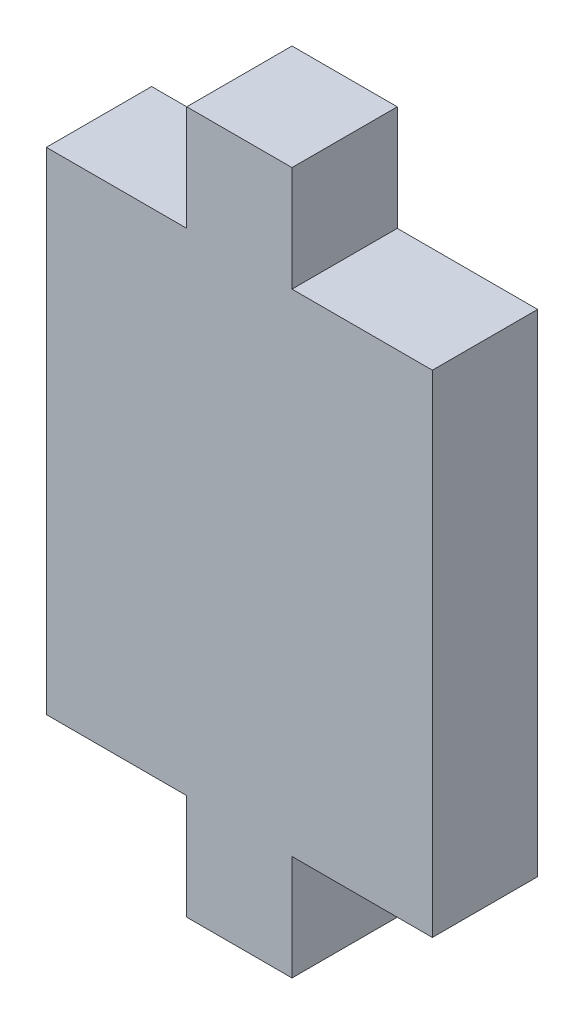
ISO-10303-21;
HEADER;
FILE_DESCRIPTION(('STEP AP214'),'2;1');
FILE_NAME('part.step','',(''),(''),'','','');
FILE_SCHEMA(('AUTOMOTIVE_DESIGN { 1 0 10303 214 1 1 1 1 }'));
ENDSEC;
DATA;
#1=APPLICATION_CONTEXT('core data for automotive mechanical design processes');
#2=APPLICATION_PROTOCOL_DEFINITION('international standard','automotive_design',2000,#1);
#3=PRODUCT_CONTEXT('',#1,'mechanical');
#4=PRODUCT('Part','Part','',(#3));
#5=PRODUCT_RELATED_PRODUCT_CATEGORY('part','',(#4));
#6=PRODUCT_DEFINITION_FORMATION('','',#4);
#7=PRODUCT_DEFINITION_CONTEXT('part definition',#1,'design');
#8=PRODUCT_DEFINITION('design','',#6,#7);
#9=PRODUCT_DEFINITION_SHAPE('','',#8);
#10=(LENGTH_UNIT() NAMED_UNIT(*) SI_UNIT(.MILLI.,.METRE.));
#11=(NAMED_UNIT(*) PLANE_ANGLE_UNIT() SI_UNIT($,.RADIAN.));
#12=(NAMED_UNIT(*) SI_UNIT($,.STERADIAN.) SOLID_ANGLE_UNIT());
#13=UNCERTAINTY_MEASURE_WITH_UNIT(LENGTH_MEASURE(1.E-05),#10,'distance_accuracy_value','');
#14=(GEOMETRIC_REPRESENTATION_CONTEXT(3) GLOBAL_UNCERTAINTY_ASSIGNED_CONTEXT((#13)) GLOBAL_UNIT_ASSIGNED_CONTEXT((#10,
#11,#12)) REPRESENTATION_CONTEXT('',''));
#15=CARTESIAN_POINT('',(0.,0.,0.));
#16=DIRECTION('',(0.,0.,1.));
#17=DIRECTION('',(1.,0.,0.));
#18=AXIS2_PLACEMENT_3D('',#15,#16,#17);
#19=CARTESIAN_POINT('',(34.925,-19.05,19.05));
#20=DIRECTION('',(0.,1.,0.));
#21=DIRECTION('',(0.,0.,1.));
#22=AXIS2_PLACEMENT_3D('',#19,#20,#21);
#23=PLANE('',#22);
#24=DIRECTION('',(1.,0.,0.));
#25=VECTOR('',#24,1.);
#26=CARTESIAN_POINT('',(34.925,-19.05,0.));
#27=LINE('',#26,#25);
#28=CARTESIAN_POINT('',(25.4,-19.05,0.));
#29=VERTEX_POINT('',#28);
#30=CARTESIAN_POINT('',(44.45,-19.05,0.));
#31=VERTEX_POINT('',#30);
#32=EDGE_CURVE('E159',#29,#31,#27,.T.);
#33=ORIENTED_EDGE('',*,*,#32,.T.);
#34=DIRECTION('',(0.,0.,-1.));
#35=VECTOR('',#34,1.);
#36=CARTESIAN_POINT('',(44.45,-19.05,19.05));
#37=LINE('',#36,#35);
#38=CARTESIAN_POINT('',(44.45,-19.05,19.05));
#39=VERTEX_POINT('',#38);
#40=EDGE_CURVE('E11',#39,#31,#37,.T.);
#41=ORIENTED_EDGE('',*,*,#40,.F.);
#42=DIRECTION('',(1.,0.,0.));
#43=VECTOR('',#42,1.);
#44=CARTESIAN_POINT('',(34.925,-19.05,19.05));
#45=LINE('',#44,#43);
#46=CARTESIAN_POINT('',(25.4,-19.05,19.05));
#47=VERTEX_POINT('',#46);
#48=EDGE_CURVE('E102',#47,#39,#45,.T.);
#49=ORIENTED_EDGE('',*,*,#48,.F.);
#50=DIRECTION('',(0.,0.,-1.));
#51=VECTOR('',#50,1.);
#52=CARTESIAN_POINT('',(25.4,-19.05,19.05));
#53=LINE('',#52,#51);
#54=EDGE_CURVE('E158',#47,#29,#53,.T.);
#55=ORIENTED_EDGE('',*,*,#54,.T.);
#56=EDGE_LOOP('',(#33,#41,#49,#55));
#57=FACE_BOUND('',#56,.T.);
#58=ADVANCED_FACE('F35',(#57),#23,.F.);
#59=CARTESIAN_POINT('',(44.45,-68.4294079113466,19.05));
#60=DIRECTION('',(1.,0.,0.));
#61=DIRECTION('',(0.,0.,-1.));
#62=AXIS2_PLACEMENT_3D('',#59,#60,#61);
#63=PLANE('',#62);
#64=DIRECTION('',(0.,-1.,0.));
#65=VECTOR('',#64,1.);
#66=CARTESIAN_POINT('',(44.45,-68.4294079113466,0.));
#67=LINE('',#66,#65);
#68=CARTESIAN_POINT('',(44.45,0.,0.));
#69=VERTEX_POINT('',#68);
#70=EDGE_CURVE('E162',#69,#31,#67,.T.);
#71=ORIENTED_EDGE('',*,*,#70,.F.);
#72=DIRECTION('',(0.,0.,-1.));
#73=VECTOR('',#72,1.);
#74=CARTESIAN_POINT('',(44.45,0.,19.05));
#75=LINE('',#74,#73);
#76=CARTESIAN_POINT('',(44.45,0.,19.05));
#77=VERTEX_POINT('',#76);
#78=EDGE_CURVE('E43',#77,#69,#75,.T.);
#79=ORIENTED_EDGE('',*,*,#78,.F.);
#80=DIRECTION('',(0.,-1.,0.));
#81=VECTOR('',#80,1.);
#82=CARTESIAN_POINT('',(44.45,-68.4294079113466,19.05));
#83=LINE('',#82,#81);
#84=EDGE_CURVE('E213',#77,#39,#83,.T.);
#85=ORIENTED_EDGE('',*,*,#84,.T.);
#86=ORIENTED_EDGE('',*,*,#40,.T.);
#87=EDGE_LOOP('',(#71,#79,#85,#86));
#88=FACE_BOUND('',#87,.T.);
#89=ADVANCED_FACE('F212',(#88),#63,.T.);
#90=CARTESIAN_POINT('',(34.925,0.,19.05));
#91=DIRECTION('',(0.,1.,0.));
#92=DIRECTION('',(0.,0.,1.));
#93=AXIS2_PLACEMENT_3D('',#90,#91,#92);
#94=PLANE('',#93);
#95=DIRECTION('',(1.,0.,0.));
#96=VECTOR('',#95,1.);
#97=CARTESIAN_POINT('',(34.925,0.,0.));
#98=LINE('',#97,#96);
#99=CARTESIAN_POINT('',(69.85,0.,0.));
#100=VERTEX_POINT('',#99);
#101=EDGE_CURVE('E165',#69,#100,#98,.T.);
#102=ORIENTED_EDGE('',*,*,#101,.T.);
#103=DIRECTION('',(0.,0.,-1.));
#104=VECTOR('',#103,1.);
#105=CARTESIAN_POINT('',(69.85,0.,19.05));
#106=LINE('',#105,#104);
#107=CARTESIAN_POINT('',(69.85,0.,19.05));
#108=VERTEX_POINT('',#107);
#109=EDGE_CURVE('E198',#108,#100,#106,.T.);
#110=ORIENTED_EDGE('',*,*,#109,.F.);
#111=DIRECTION('',(1.,0.,0.));
#112=VECTOR('',#111,1.);
#113=CARTESIAN_POINT('',(34.925,0.,19.05));
#114=LINE('',#113,#112);
#115=EDGE_CURVE('E144',#77,#108,#114,.T.);
#116=ORIENTED_EDGE('',*,*,#115,.F.);
#117=ORIENTED_EDGE('',*,*,#78,.T.);
#118=EDGE_LOOP('',(#102,#110,#116,#117));
#119=FACE_BOUND('',#118,.T.);
#120=ADVANCED_FACE('F203',(#119),#94,.F.);
#121=CARTESIAN_POINT('',(69.85,-68.4294079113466,19.05));
#122=DIRECTION('',(-1.,0.,0.));
#123=DIRECTION('',(0.,0.,1.));
#124=AXIS2_PLACEMENT_3D('',#121,#122,#123);
#125=PLANE('',#124);
#126=DIRECTION('',(0.,1.,0.));
#127=VECTOR('',#126,1.);
#128=CARTESIAN_POINT('',(69.85,-68.4294079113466,0.));
#129=LINE('',#128,#127);
#130=CARTESIAN_POINT('',(69.85,88.9,0.));
#131=VERTEX_POINT('',#130);
#132=EDGE_CURVE('E167',#100,#131,#129,.T.);
#133=ORIENTED_EDGE('',*,*,#132,.T.);
#134=DIRECTION('',(0.,0.,-1.));
#135=VECTOR('',#134,1.);
#136=CARTESIAN_POINT('',(69.85,88.9,19.05));
#137=LINE('',#136,#135);
#138=CARTESIAN_POINT('',(69.85,88.9,19.05));
#139=VERTEX_POINT('',#138);
#140=EDGE_CURVE('E196',#139,#131,#137,.T.);
#141=ORIENTED_EDGE('',*,*,#140,.F.);
#142=DIRECTION('',(0.,1.,0.));
#143=VECTOR('',#142,1.);
#144=CARTESIAN_POINT('',(69.85,-68.4294079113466,19.05));
#145=LINE('',#144,#143);
#146=EDGE_CURVE('E241',#108,#139,#145,.T.);
#147=ORIENTED_EDGE('',*,*,#146,.F.);
#148=ORIENTED_EDGE('',*,*,#109,.T.);
#149=EDGE_LOOP('',(#133,#141,#147,#148));
#150=FACE_BOUND('',#149,.T.);
#151=ADVANCED_FACE('F240',(#150),#125,.F.);
#152=CARTESIAN_POINT('',(34.925,88.9,19.05));
#153=DIRECTION('',(0.,1.,0.));
#154=DIRECTION('',(0.,0.,1.));
#155=AXIS2_PLACEMENT_3D('',#152,#153,#154);
#156=PLANE('',#155);
#157=DIRECTION('',(1.,0.,0.));
#158=VECTOR('',#157,1.);
#159=CARTESIAN_POINT('',(34.925,88.9,0.));
#160=LINE('',#159,#158);
#161=CARTESIAN_POINT('',(44.45,88.9,0.));
#162=VERTEX_POINT('',#161);
#163=EDGE_CURVE('E170',#162,#131,#160,.T.);
#164=ORIENTED_EDGE('',*,*,#163,.F.);
#165=DIRECTION('',(0.,0.,-1.));
#166=VECTOR('',#165,1.);
#167=CARTESIAN_POINT('',(44.45,88.9,19.05));
#168=LINE('',#167,#166);
#169=CARTESIAN_POINT('',(44.45,88.9,19.05));
#170=VERTEX_POINT('',#169);
#171=EDGE_CURVE('E194',#170,#162,#168,.T.);
#172=ORIENTED_EDGE('',*,*,#171,.F.);
#173=DIRECTION('',(1.,0.,0.));
#174=VECTOR('',#173,1.);
#175=CARTESIAN_POINT('',(34.925,88.9,19.05));
#176=LINE('',#175,#174);
#177=EDGE_CURVE('E153',#170,#139,#176,.T.);
#178=ORIENTED_EDGE('',*,*,#177,.T.);
#179=ORIENTED_EDGE('',*,*,#140,.T.);
#180=EDGE_LOOP('',(#164,#172,#178,#179));
#181=FACE_BOUND('',#180,.T.);
#182=ADVANCED_FACE('F233',(#181),#156,.T.);
#183=CARTESIAN_POINT('',(44.45,-68.4294079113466,19.05));
#184=DIRECTION('',(-1.,0.,0.));
#185=DIRECTION('',(0.,0.,1.));
#186=AXIS2_PLACEMENT_3D('',#183,#184,#185);
#187=PLANE('',#186);
#188=DIRECTION('',(0.,1.,0.));
#189=VECTOR('',#188,1.);
#190=CARTESIAN_POINT('',(44.45,-68.4294079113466,0.));
#191=LINE('',#190,#189);
#192=CARTESIAN_POINT('',(44.45,107.95,0.));
#193=VERTEX_POINT('',#192);
#194=EDGE_CURVE('E173',#162,#193,#191,.T.);
#195=ORIENTED_EDGE('',*,*,#194,.T.);
#196=DIRECTION('',(0.,0.,-1.));
#197=VECTOR('',#196,1.);
#198=CARTESIAN_POINT('',(44.45,107.95,19.05));
#199=LINE('',#198,#197);
#200=CARTESIAN_POINT('',(44.45,107.95,19.05));
#201=VERTEX_POINT('',#200);
#202=EDGE_CURVE('E192',#201,#193,#199,.T.);
#203=ORIENTED_EDGE('',*,*,#202,.F.);
#204=DIRECTION('',(0.,1.,0.));
#205=VECTOR('',#204,1.);
#206=CARTESIAN_POINT('',(44.45,-68.4294079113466,19.05));
#207=LINE('',#206,#205);
#208=EDGE_CURVE('E243',#170,#201,#207,.T.);
#209=ORIENTED_EDGE('',*,*,#208,.F.);
#210=ORIENTED_EDGE('',*,*,#171,.T.);
#211=EDGE_LOOP('',(#195,#203,#209,#210));
#212=FACE_BOUND('',#211,.T.);
#213=ADVANCED_FACE('F247',(#212),#187,.F.);
#214=CARTESIAN_POINT('',(34.925,107.95,19.05));
#215=DIRECTION('',(0.,1.,0.));
#216=DIRECTION('',(0.,0.,1.));
#217=AXIS2_PLACEMENT_3D('',#214,#215,#216);
#218=PLANE('',#217);
#219=DIRECTION('',(1.,0.,0.));
#220=VECTOR('',#219,1.);
#221=CARTESIAN_POINT('',(34.925,107.95,0.));
#222=LINE('',#221,#220);
#223=CARTESIAN_POINT('',(25.4,107.95,0.));
#224=VERTEX_POINT('',#223);
#225=EDGE_CURVE('E177',#224,#193,#222,.T.);
#226=ORIENTED_EDGE('',*,*,#225,.F.);
#227=DIRECTION('',(0.,0.,-1.));
#228=VECTOR('',#227,1.);
#229=CARTESIAN_POINT('',(25.4,107.95,19.05));
#230=LINE('',#229,#228);
#231=CARTESIAN_POINT('',(25.4,107.95,19.05));
#232=VERTEX_POINT('',#231);
#233=EDGE_CURVE('E190',#232,#224,#230,.T.);
#234=ORIENTED_EDGE('',*,*,#233,.F.);
#235=DIRECTION('',(1.,0.,0.));
#236=VECTOR('',#235,1.);
#237=CARTESIAN_POINT('',(34.925,107.95,19.05));
#238=LINE('',#237,#236);
#239=EDGE_CURVE('E246',#232,#201,#238,.T.);
#240=ORIENTED_EDGE('',*,*,#239,.T.);
#241=ORIENTED_EDGE('',*,*,#202,.T.);
#242=EDGE_LOOP('',(#226,#234,#240,#241));
#243=FACE_BOUND('',#242,.T.);
#244=ADVANCED_FACE('F227',(#243),#218,.T.);
#245=CARTESIAN_POINT('',(25.4,-68.4294079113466,19.05));
#246=DIRECTION('',(-1.,0.,0.));
#247=DIRECTION('',(0.,0.,1.));
#248=AXIS2_PLACEMENT_3D('',#245,#246,#247);
#249=PLANE('',#248);
#250=DIRECTION('',(0.,1.,0.));
#251=VECTOR('',#250,1.);
#252=CARTESIAN_POINT('',(25.4,-68.4294079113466,0.));
#253=LINE('',#252,#251);
#254=CARTESIAN_POINT('',(25.4,88.9,0.));
#255=VERTEX_POINT('',#254);
#256=EDGE_CURVE('E180',#255,#224,#253,.T.);
#257=ORIENTED_EDGE('',*,*,#256,.F.);
#258=DIRECTION('',(0.,0.,-1.));
#259=VECTOR('',#258,1.);
#260=CARTESIAN_POINT('',(25.4,88.9,19.05));
#261=LINE('',#260,#259);
#262=CARTESIAN_POINT('',(25.4,88.9,19.05));
#263=VERTEX_POINT('',#262);
#264=EDGE_CURVE('E188',#263,#255,#261,.T.);
#265=ORIENTED_EDGE('',*,*,#264,.F.);
#266=DIRECTION('',(0.,1.,0.));
#267=VECTOR('',#266,1.);
#268=CARTESIAN_POINT('',(25.4,-68.4294079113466,19.05));
#269=LINE('',#268,#267);
#270=EDGE_CURVE('E151',#263,#232,#269,.T.);
#271=ORIENTED_EDGE('',*,*,#270,.T.);
#272=ORIENTED_EDGE('',*,*,#233,.T.);
#273=EDGE_LOOP('',(#257,#265,#271,#272));
#274=FACE_BOUND('',#273,.T.);
#275=ADVANCED_FACE('F222',(#274),#249,.T.);
#276=CARTESIAN_POINT('',(0.,88.9,0.));
#277=VERTEX_POINT('',#276);
#278=EDGE_CURVE('E174',#277,#255,#160,.T.);
#279=ORIENTED_EDGE('',*,*,#278,.F.);
#280=DIRECTION('',(0.,0.,-1.));
#281=VECTOR('',#280,1.);
#282=CARTESIAN_POINT('',(0.,88.9,19.05));
#283=LINE('',#282,#281);
#284=CARTESIAN_POINT('',(0.,88.9,19.05));
#285=VERTEX_POINT('',#284);
#286=EDGE_CURVE('E138',#285,#277,#283,.T.);
#287=ORIENTED_EDGE('',*,*,#286,.F.);
#288=EDGE_CURVE('E149',#285,#263,#176,.T.);
#289=ORIENTED_EDGE('',*,*,#288,.T.);
#290=ORIENTED_EDGE('',*,*,#264,.T.);
#291=EDGE_LOOP('',(#279,#287,#289,#290));
#292=FACE_BOUND('',#291,.T.);
#293=ADVANCED_FACE('F219',(#292),#156,.T.);
#294=CARTESIAN_POINT('',(0.,-68.4294079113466,19.05));
#295=DIRECTION('',(-1.,0.,0.));
#296=DIRECTION('',(0.,0.,1.));
#297=AXIS2_PLACEMENT_3D('',#294,#295,#296);
#298=PLANE('',#297);
#299=DIRECTION('',(0.,1.,0.));
#300=VECTOR('',#299,1.);
#301=CARTESIAN_POINT('',(0.,-68.4294079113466,0.));
#302=LINE('',#301,#300);
#303=CARTESIAN_POINT('',(0.,0.,0.));
#304=VERTEX_POINT('',#303);
#305=EDGE_CURVE('E137',#304,#277,#302,.T.);
#306=ORIENTED_EDGE('',*,*,#305,.F.);
#307=DIRECTION('',(0.,0.,-1.));
#308=VECTOR('',#307,1.);
#309=CARTESIAN_POINT('',(0.,0.,19.05));
#310=LINE('',#309,#308);
#311=CARTESIAN_POINT('',(0.,0.,19.05));
#312=VERTEX_POINT('',#311);
#313=EDGE_CURVE('E131',#312,#304,#310,.T.);
#314=ORIENTED_EDGE('',*,*,#313,.F.);
#315=DIRECTION('',(0.,1.,0.));
#316=VECTOR('',#315,1.);
#317=CARTESIAN_POINT('',(0.,-68.4294079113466,19.05));
#318=LINE('',#317,#316);
#319=EDGE_CURVE('E135',#312,#285,#318,.T.);
#320=ORIENTED_EDGE('',*,*,#319,.T.);
#321=ORIENTED_EDGE('',*,*,#286,.T.);
#322=EDGE_LOOP('',(#306,#314,#320,#321));
#323=FACE_BOUND('',#322,.T.);
#324=ADVANCED_FACE('F133',(#323),#298,.T.);
#325=CARTESIAN_POINT('',(25.4,0.,0.));
#326=VERTEX_POINT('',#325);
#327=EDGE_CURVE('E90',#304,#326,#98,.T.);
#328=ORIENTED_EDGE('',*,*,#327,.T.);
#329=DIRECTION('',(0.,0.,-1.));
#330=VECTOR('',#329,1.);
#331=CARTESIAN_POINT('',(25.4,0.,19.05));
#332=LINE('',#331,#330);
#333=CARTESIAN_POINT('',(25.4,0.,19.05));
#334=VERTEX_POINT('',#333);
#335=EDGE_CURVE('E139',#334,#326,#332,.T.);
#336=ORIENTED_EDGE('',*,*,#335,.F.);
#337=EDGE_CURVE('E141',#312,#334,#114,.T.);
#338=ORIENTED_EDGE('',*,*,#337,.F.);
#339=ORIENTED_EDGE('',*,*,#313,.T.);
#340=EDGE_LOOP('',(#328,#336,#338,#339));
#341=FACE_BOUND('',#340,.T.);
#342=ADVANCED_FACE('F142',(#341),#94,.F.);
#343=CARTESIAN_POINT('',(25.4,-68.4294079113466,19.05));
#344=DIRECTION('',(1.,0.,0.));
#345=DIRECTION('',(0.,0.,-1.));
#346=AXIS2_PLACEMENT_3D('',#343,#344,#345);
#347=PLANE('',#346);
#348=DIRECTION('',(0.,-1.,0.));
#349=VECTOR('',#348,1.);
#350=CARTESIAN_POINT('',(25.4,-68.4294079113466,0.));
#351=LINE('',#350,#349);
#352=EDGE_CURVE('E96',#326,#29,#351,.T.);
#353=ORIENTED_EDGE('',*,*,#352,.T.);
#354=ORIENTED_EDGE('',*,*,#54,.F.);
#355=DIRECTION('',(0.,-1.,0.));
#356=VECTOR('',#355,1.);
#357=CARTESIAN_POINT('',(25.4,-68.4294079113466,19.05));
#358=LINE('',#357,#356);
#359=EDGE_CURVE('E51',#334,#47,#358,.T.);
#360=ORIENTED_EDGE('',*,*,#359,.F.);
#361=ORIENTED_EDGE('',*,*,#335,.T.);
#362=EDGE_LOOP('',(#353,#354,#360,#361));
#363=FACE_BOUND('',#362,.T.);
#364=ADVANCED_FACE('F316',(#363),#347,.F.);
#365=CARTESIAN_POINT('',(34.925,-68.4294079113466,19.05));
#366=DIRECTION('',(0.,0.,1.));
#367=DIRECTION('',(1.,0.,0.));
#368=AXIS2_PLACEMENT_3D('',#365,#366,#367);
#369=PLANE('',#368);
#370=ORIENTED_EDGE('',*,*,#48,.T.);
#371=ORIENTED_EDGE('',*,*,#84,.F.);
#372=ORIENTED_EDGE('',*,*,#115,.T.);
#373=ORIENTED_EDGE('',*,*,#146,.T.);
#374=ORIENTED_EDGE('',*,*,#177,.F.);
#375=ORIENTED_EDGE('',*,*,#208,.T.);
#376=ORIENTED_EDGE('',*,*,#239,.F.);
#377=ORIENTED_EDGE('',*,*,#270,.F.);
#378=ORIENTED_EDGE('',*,*,#288,.F.);
#379=ORIENTED_EDGE('',*,*,#319,.F.);
#380=ORIENTED_EDGE('',*,*,#337,.T.);
#381=ORIENTED_EDGE('',*,*,#359,.T.);
#382=EDGE_LOOP('',(#370,#371,#372,#373,#374,#375,#376,#377,#378,#379,#380,#381));
#383=FACE_BOUND('',#382,.T.);
#384=ADVANCED_FACE('F146',(#383),#369,.T.);
#385=CARTESIAN_POINT('',(34.925,-68.4294079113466,0.));
#386=DIRECTION('',(0.,0.,1.));
#387=DIRECTION('',(1.,0.,0.));
#388=AXIS2_PLACEMENT_3D('',#385,#386,#387);
#389=PLANE('',#388);
#390=ORIENTED_EDGE('',*,*,#32,.F.);
#391=ORIENTED_EDGE('',*,*,#352,.F.);
#392=ORIENTED_EDGE('',*,*,#327,.F.);
#393=ORIENTED_EDGE('',*,*,#305,.T.);
#394=ORIENTED_EDGE('',*,*,#278,.T.);
#395=ORIENTED_EDGE('',*,*,#256,.T.);
#396=ORIENTED_EDGE('',*,*,#225,.T.);
#397=ORIENTED_EDGE('',*,*,#194,.F.);
#398=ORIENTED_EDGE('',*,*,#163,.T.);
#399=ORIENTED_EDGE('',*,*,#132,.F.);
#400=ORIENTED_EDGE('',*,*,#101,.F.);
#401=ORIENTED_EDGE('',*,*,#70,.T.);
#402=EDGE_LOOP('',(#390,#391,#392,#393,#394,#395,#396,#397,#398,#399,#400,#401));
#403=FACE_BOUND('',#402,.T.);
#404=ADVANCED_FACE('F211',(#403),#389,.F.);
#405=CLOSED_SHELL('',(#58,#89,#120,#151,#182,#213,#244,#275,#293,#324,#342,#364,#384,#404));
#406=MANIFOLD_SOLID_BREP('B2',#405);
#407=ADVANCED_BREP_SHAPE_REPRESENTATION('',(#18,#406),#14);
#408=SHAPE_DEFINITION_REPRESENTATION(#9,#407);
ENDSEC;
END-ISO-10303-21;
